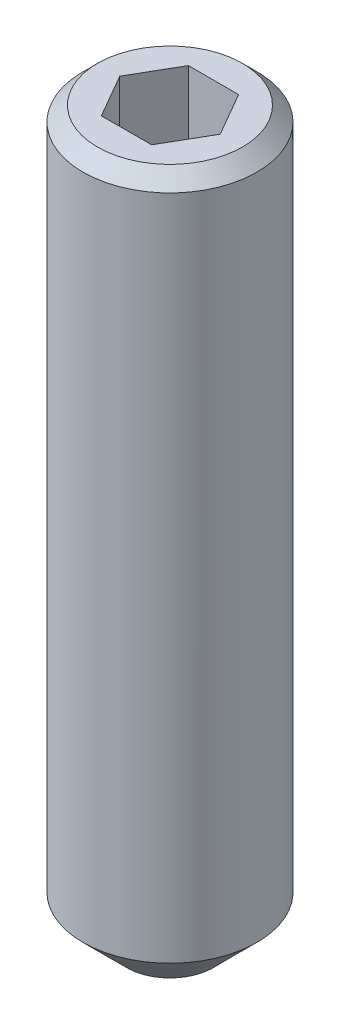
from build123d import *

# Parameters (mm, degrees)
ESQUISSE1_R             = 3
LONGUEUR_FILT_DEPTH     = 25
CHANFREIN1_SIZE         = 0.5
ENL_V_MAT_EXTRU_4_DEPTH = 3.5
ESQUISSE11_OUTSIDE_W    = 65.996
ESQUISSE11_OUTSIDE_H    = 65.996
ESQUISSE11_OUTSIDE_R    = 1.5
ENL_V_MAT_EXTRU_5_DEPTH = 26.357444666
ENL_V_MAT_EXTRU_5_DRAFT = -45


with BuildPart() as part:
    # Esquisse1 → Longueur filt (new body)
    with BuildSketch(Plane(origin=(0, 0, 0), x_dir=(1, 0, 0), z_dir=(0, 1, 0))):
        with Locations(Location((0, 0, 0), (0, 0, 270))):
            Circle(ESQUISSE1_R)
    extrude(amount=LONGUEUR_FILT_DEPTH)

    # Chanfrein1
    chanfrein1_edges = [part.edges().sort_by_distance(p)[0] for p in [
        (0, 25, -3),
    ]]
    chamfer(chanfrein1_edges, length=CHANFREIN1_SIZE)

    # Esquisse6 → Enl_v. mat.-Extru.4 (cut)
    with BuildSketch(Plane(origin=(0, 25, 0), x_dir=(-1, 0, 0), z_dir=(0, -1, 0))):
        Polygon((1.732050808, 0), (0.866025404, 1.5), (-0.866025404, 1.5), (-1.732050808, 0), (-0.866025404, -1.5), (0.866025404, -1.5), align=None)
    extrude(amount=ENL_V_MAT_EXTRU_4_DEPTH, mode=Mode.SUBTRACT)

    # Esquisse9 → Enl_vement de mati_re-R_volution1 (revolve, cut)
    with BuildSketch(Plane(origin=(0, 0, 0), x_dir=(0, 0, -1), z_dir=(1, 0, 0)), mode=Mode.PRIVATE) as enl_vement_de_mati_re_r_volution1_sk:
        Polygon((0, 0), (0, 0.866025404), (-1.5, 0), align=None)
    revolve(enl_vement_de_mati_re_r_volution1_sk.sketch.rotate(Axis((0, 0, 0), (0, 1, 0)), 180), axis=Axis((0, 0, 0), (0, 1, 0)), mode=Mode.SUBTRACT)


with BuildPart() as enl_v_mat_extru_5_tool:
    # Esquisse11 outside → Enl_v. mat.-Extru.5 (with draft: the straight prism first)
    with BuildSketch(Plane.XZ):
        Rectangle(ESQUISSE11_OUTSIDE_W, ESQUISSE11_OUTSIDE_H)
        Circle(ESQUISSE11_OUTSIDE_R, mode=Mode.SUBTRACT)
    extrude(amount=-ENL_V_MAT_EXTRU_5_DEPTH)
    # Enl_v. mat.-Extru.5: the draft: its side faces are tilted about the plane it starts from
    enl_v_mat_extru_5_sides = [enl_v_mat_extru_5_tool.faces().sort_by_distance(p)[0] for p in [
        (0, 13.178722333, -32.998),
        (32.998, 13.178722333, 0),
        (0, 13.178722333, 32.998),
        (-32.998, 13.178722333, 0),
        (-1.5, 13.178722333, 0),
    ]]
    draft(enl_v_mat_extru_5_sides, Plane.XZ, ENL_V_MAT_EXTRU_5_DRAFT)


with BuildPart() as part_1:
    add(part.part)

    # Enl_v. mat.-Extru.5: cut by enl_v_mat_extru_5_tool
    add(enl_v_mat_extru_5_tool.part, mode=Mode.SUBTRACT)


solid = part_1.part
